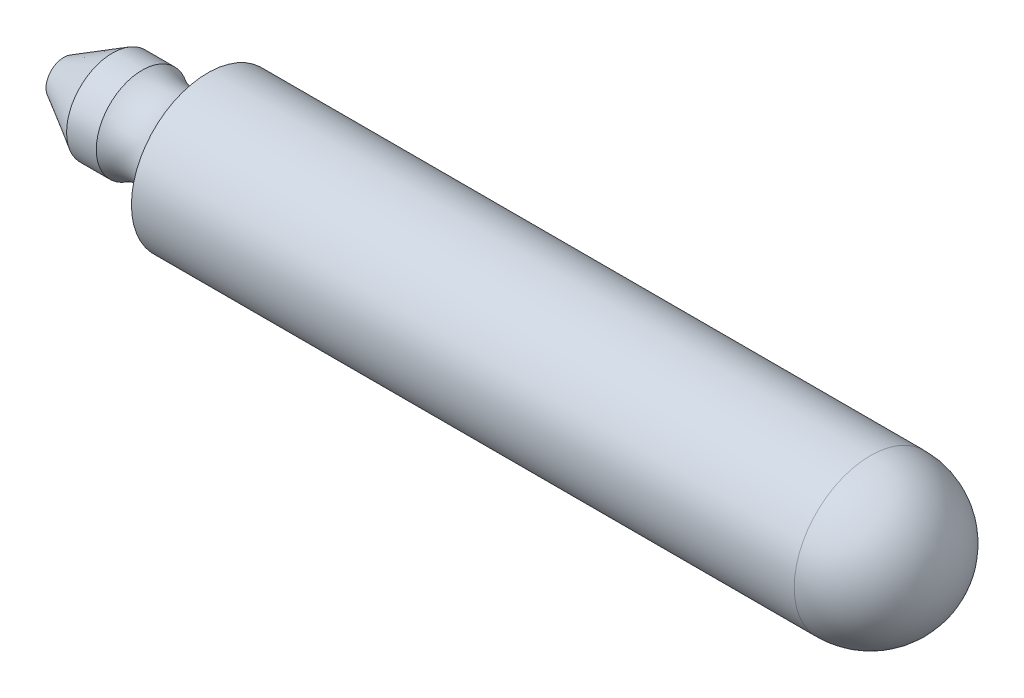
ISO-10303-21;
HEADER;
FILE_DESCRIPTION(('STEP AP214'),'2;1');
FILE_NAME('part.step','',(''),(''),'','','');
FILE_SCHEMA(('AUTOMOTIVE_DESIGN { 1 0 10303 214 1 1 1 1 }'));
ENDSEC;
DATA;
#1=APPLICATION_CONTEXT('core data for automotive mechanical design processes');
#2=APPLICATION_PROTOCOL_DEFINITION('international standard','automotive_design',2000,#1);
#3=PRODUCT_CONTEXT('',#1,'mechanical');
#4=PRODUCT('Part','Part','',(#3));
#5=PRODUCT_RELATED_PRODUCT_CATEGORY('part','',(#4));
#6=PRODUCT_DEFINITION_FORMATION('','',#4);
#7=PRODUCT_DEFINITION_CONTEXT('part definition',#1,'design');
#8=PRODUCT_DEFINITION('design','',#6,#7);
#9=PRODUCT_DEFINITION_SHAPE('','',#8);
#10=(LENGTH_UNIT() NAMED_UNIT(*) SI_UNIT(.MILLI.,.METRE.));
#11=(NAMED_UNIT(*) PLANE_ANGLE_UNIT() SI_UNIT($,.RADIAN.));
#12=(NAMED_UNIT(*) SI_UNIT($,.STERADIAN.) SOLID_ANGLE_UNIT());
#13=UNCERTAINTY_MEASURE_WITH_UNIT(LENGTH_MEASURE(1.E-05),#10,'distance_accuracy_value','');
#14=(GEOMETRIC_REPRESENTATION_CONTEXT(3) GLOBAL_UNCERTAINTY_ASSIGNED_CONTEXT((#13)) GLOBAL_UNIT_ASSIGNED_CONTEXT((#10,
#11,#12)) REPRESENTATION_CONTEXT('',''));
#15=CARTESIAN_POINT('',(0.,0.,0.));
#16=DIRECTION('',(0.,0.,1.));
#17=DIRECTION('',(1.,0.,0.));
#18=AXIS2_PLACEMENT_3D('',#15,#16,#17);
#19=CARTESIAN_POINT('',(0.,0.,0.));
#20=DIRECTION('',(1.,0.,0.));
#21=DIRECTION('',(0.,0.,-1.));
#22=AXIS2_PLACEMENT_3D('',#19,#20,#21);
#23=PLANE('',#22);
#24=CARTESIAN_POINT('',(0.,0.,0.));
#25=DIRECTION('',(-1.,0.,0.));
#26=DIRECTION('',(0.,0.,1.));
#27=AXIS2_PLACEMENT_3D('',#24,#25,#26);
#28=CIRCLE('',#27,0.3175);
#29=CARTESIAN_POINT('',(0.,0.,0.3175));
#30=VERTEX_POINT('',#29);
#31=EDGE_CURVE('E10',#30,#30,#28,.T.);
#32=ORIENTED_EDGE('',*,*,#31,.T.);
#33=EDGE_LOOP('',(#32));
#34=FACE_BOUND('',#33,.T.);
#35=ADVANCED_FACE('F31',(#34),#23,.F.);
#36=CARTESIAN_POINT('',(0.868883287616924,0.,0.));
#37=DIRECTION('',(1.,0.,0.));
#38=DIRECTION('',(0.,0.,-1.));
#39=AXIS2_PLACEMENT_3D('',#36,#37,#38);
#40=CONICAL_SURFACE('',#39,0.81915,0.5235987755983);
#41=ORIENTED_EDGE('',*,*,#31,.F.);
#42=EDGE_LOOP('',(#41));
#43=FACE_BOUND('',#42,.T.);
#44=CARTESIAN_POINT('',(0.868883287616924,0.,0.));
#45=DIRECTION('',(-1.,0.,0.));
#46=DIRECTION('',(0.,0.,1.));
#47=AXIS2_PLACEMENT_3D('',#44,#45,#46);
#48=CIRCLE('',#47,0.81915);
#49=CARTESIAN_POINT('',(0.868883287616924,0.,0.81915));
#50=VERTEX_POINT('',#49);
#51=EDGE_CURVE('E37',#50,#50,#48,.T.);
#52=ORIENTED_EDGE('',*,*,#51,.T.);
#53=EDGE_LOOP('',(#52));
#54=FACE_BOUND('',#53,.T.);
#55=ADVANCED_FACE('F66',(#43,#54),#40,.T.);
#56=CARTESIAN_POINT('',(0.,0.,0.));
#57=DIRECTION('',(-1.,0.,0.));
#58=DIRECTION('',(0.,0.,1.));
#59=AXIS2_PLACEMENT_3D('',#56,#57,#58);
#60=CYLINDRICAL_SURFACE('',#59,0.81915);
#61=ORIENTED_EDGE('',*,*,#51,.F.);
#62=EDGE_LOOP('',(#61));
#63=FACE_BOUND('',#62,.T.);
#64=CARTESIAN_POINT('',(1.39872566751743,0.,0.));
#65=DIRECTION('',(-1.,0.,0.));
#66=DIRECTION('',(0.,0.,1.));
#67=AXIS2_PLACEMENT_3D('',#64,#65,#66);
#68=CIRCLE('',#67,0.81915);
#69=CARTESIAN_POINT('',(1.39872566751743,0.,0.81915));
#70=VERTEX_POINT('',#69);
#71=EDGE_CURVE('E41',#70,#70,#68,.T.);
#72=ORIENTED_EDGE('',*,*,#71,.T.);
#73=EDGE_LOOP('',(#72));
#74=FACE_BOUND('',#73,.T.);
#75=ADVANCED_FACE('F70',(#63,#74),#60,.T.);
#76=CARTESIAN_POINT('',(1.81020370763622,0.,0.));
#77=DIRECTION('',(-1.,0.,0.));
#78=DIRECTION('',(0.,0.,1.));
#79=AXIS2_PLACEMENT_3D('',#76,#77,#78);
#80=TOROIDAL_SURFACE('',#79,1.4605,0.762);
#81=ORIENTED_EDGE('',*,*,#71,.F.);
#82=EDGE_LOOP('',(#81));
#83=FACE_BOUND('',#82,.T.);
#84=CARTESIAN_POINT('',(2.5654,0.,0.));
#85=DIRECTION('',(-1.,0.,0.));
#86=DIRECTION('',(0.,0.,1.));
#87=AXIS2_PLACEMENT_3D('',#84,#85,#86);
#88=CIRCLE('',#87,1.3589);
#89=CARTESIAN_POINT('',(2.5654,0.,1.3589));
#90=VERTEX_POINT('',#89);
#91=EDGE_CURVE('E45',#90,#90,#88,.T.);
#92=ORIENTED_EDGE('',*,*,#91,.T.);
#93=EDGE_LOOP('',(#92));
#94=FACE_BOUND('',#93,.T.);
#95=ADVANCED_FACE('F62',(#83,#94),#80,.F.);
#96=CARTESIAN_POINT('',(0.,0.,0.));
#97=DIRECTION('',(-1.,0.,0.));
#98=DIRECTION('',(0.,0.,1.));
#99=AXIS2_PLACEMENT_3D('',#96,#97,#98);
#100=CYLINDRICAL_SURFACE('',#99,1.3589);
#101=ORIENTED_EDGE('',*,*,#91,.F.);
#102=EDGE_LOOP('',(#101));
#103=FACE_BOUND('',#102,.T.);
#104=CARTESIAN_POINT('',(14.3891,0.,0.));
#105=DIRECTION('',(-1.,0.,0.));
#106=DIRECTION('',(0.,0.,1.));
#107=AXIS2_PLACEMENT_3D('',#104,#105,#106);
#108=CIRCLE('',#107,1.3589);
#109=CARTESIAN_POINT('',(14.3891,0.,1.3589));
#110=VERTEX_POINT('',#109);
#111=EDGE_CURVE('E50',#110,#110,#108,.T.);
#112=ORIENTED_EDGE('',*,*,#111,.T.);
#113=EDGE_LOOP('',(#112));
#114=FACE_BOUND('',#113,.T.);
#115=ADVANCED_FACE('F54',(#103,#114),#100,.T.);
#116=CARTESIAN_POINT('',(14.3891,0.,0.));
#117=DIRECTION('',(-1.,0.,0.));
#118=DIRECTION('',(0.,1.,0.));
#119=AXIS2_PLACEMENT_3D('',#116,#117,#118);
#120=SPHERICAL_SURFACE('',#119,1.3589);
#121=ORIENTED_EDGE('',*,*,#111,.F.);
#122=EDGE_LOOP('',(#121));
#123=FACE_BOUND('',#122,.T.);
#124=ADVANCED_FACE('F56',(#123),#120,.T.);
#125=CLOSED_SHELL('',(#35,#55,#75,#95,#115,#124));
#126=MANIFOLD_SOLID_BREP('B2',#125);
#127=ADVANCED_BREP_SHAPE_REPRESENTATION('',(#18,#126),#14);
#128=SHAPE_DEFINITION_REPRESENTATION(#9,#127);
ENDSEC;
END-ISO-10303-21;
